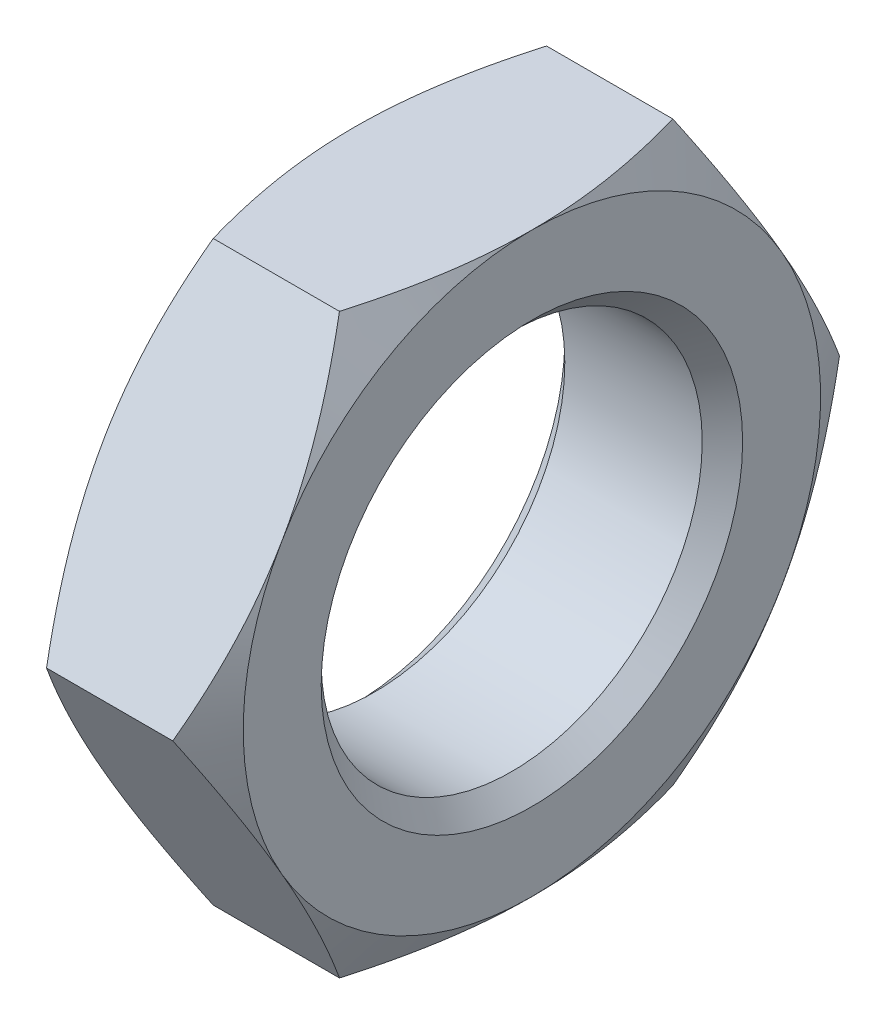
from build123d import *

# Parameters (mm, degrees)
SKETCH1_R      = 16.5
EXTRUDE1_DEPTH = 15.4
CHAMFER1_SIZE  = 1.75


with BuildPart() as part:
    # Sketch1 → Extrude1 (new body)
    with BuildSketch(Plane(origin=(0, 0, 0), x_dir=(0, 0, -1), z_dir=(1, 0, 0))):
        Polygon((14.43375673, 25), (-14.43375673, 25), (-28.867513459, 0), (-14.43375673, -25), (14.43375673, -25), (28.867513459, 0), align=None)
        with Locations(Location((0, 0, 0), (0, 0, 180))):
            Circle(SKETCH1_R, mode=Mode.SUBTRACT)
    extrude(amount=EXTRUDE1_DEPTH)

    # Sketch2 → Cut-Revolve1 (revolve, cut)
    with BuildSketch(Plane.XY):
        Polygon((15.4, 25), (15.4, 100), (0, 100), (0, 25), (7.7, 38.336791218), align=None)
    revolve(axis=Axis((15.4, 0, 0), (-1, 0, 0)), mode=Mode.SUBTRACT)

    # Chamfer1
    chamfer1_edges = [part.edges().sort_by_distance(p)[0] for p in [
        (0, 0, -16.5),
        (15.4, 0, -16.5),
    ]]
    chamfer(chamfer1_edges, length=CHAMFER1_SIZE)


solid = part.part
